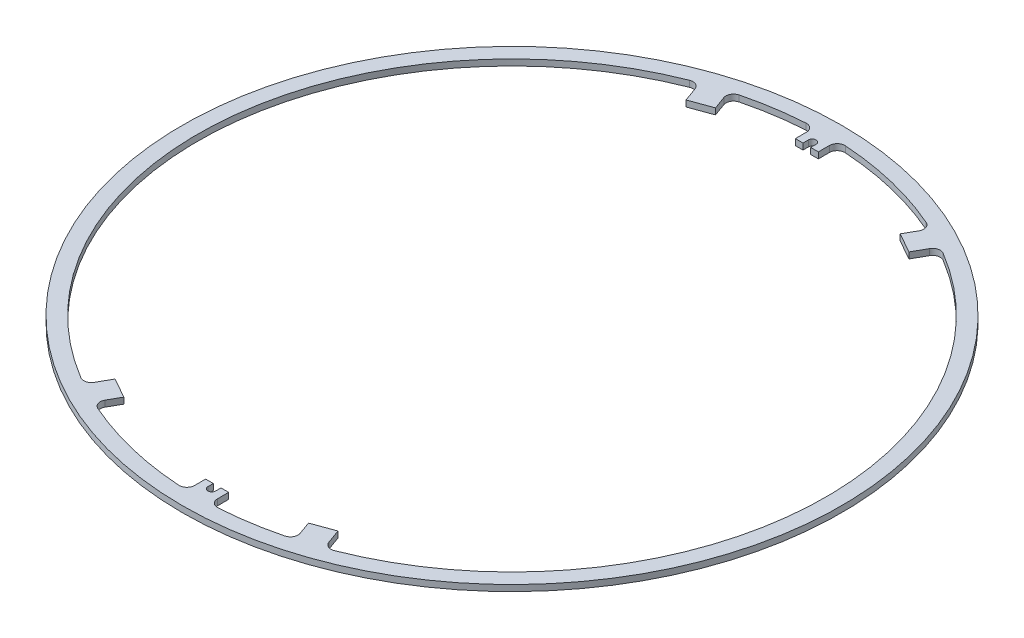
ISO-10303-21;
HEADER;
FILE_DESCRIPTION(('STEP AP214'),'2;1');
FILE_NAME('part.step','',(''),(''),'','','');
FILE_SCHEMA(('AUTOMOTIVE_DESIGN { 1 0 10303 214 1 1 1 1 }'));
ENDSEC;
DATA;
#1=APPLICATION_CONTEXT('core data for automotive mechanical design processes');
#2=APPLICATION_PROTOCOL_DEFINITION('international standard','automotive_design',2000,#1);
#3=PRODUCT_CONTEXT('',#1,'mechanical');
#4=PRODUCT('Part','Part','',(#3));
#5=PRODUCT_RELATED_PRODUCT_CATEGORY('part','',(#4));
#6=PRODUCT_DEFINITION_FORMATION('','',#4);
#7=PRODUCT_DEFINITION_CONTEXT('part definition',#1,'design');
#8=PRODUCT_DEFINITION('design','',#6,#7);
#9=PRODUCT_DEFINITION_SHAPE('','',#8);
#10=(LENGTH_UNIT() NAMED_UNIT(*) SI_UNIT(.MILLI.,.METRE.));
#11=(NAMED_UNIT(*) PLANE_ANGLE_UNIT() SI_UNIT($,.RADIAN.));
#12=(NAMED_UNIT(*) SI_UNIT($,.STERADIAN.) SOLID_ANGLE_UNIT());
#13=UNCERTAINTY_MEASURE_WITH_UNIT(LENGTH_MEASURE(1.E-05),#10,'distance_accuracy_value','');
#14=(GEOMETRIC_REPRESENTATION_CONTEXT(3) GLOBAL_UNCERTAINTY_ASSIGNED_CONTEXT((#13)) GLOBAL_UNIT_ASSIGNED_CONTEXT((#10,
#11,#12)) REPRESENTATION_CONTEXT('',''));
#15=CARTESIAN_POINT('',(0.,0.,0.));
#16=DIRECTION('',(0.,0.,1.));
#17=DIRECTION('',(1.,0.,0.));
#18=AXIS2_PLACEMENT_3D('',#15,#16,#17);
#19=CARTESIAN_POINT('',(0.,0.8,0.));
#20=DIRECTION('',(0.,-1.,0.));
#21=DIRECTION('',(0.,0.,-1.));
#22=AXIS2_PLACEMENT_3D('',#19,#20,#21);
#23=CYLINDRICAL_SURFACE('',#22,41.);
#24=CARTESIAN_POINT('',(0.,0.8,0.));
#25=DIRECTION('',(0.,1.,0.));
#26=DIRECTION('',(0.,0.,1.));
#27=AXIS2_PLACEMENT_3D('',#24,#25,#26);
#28=CIRCLE('',#27,41.);
#29=CARTESIAN_POINT('',(-2.5625,0.8,-40.9198435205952));
#30=VERTEX_POINT('',#29);
#31=CARTESIAN_POINT('',(-10.0997958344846,0.8,-39.7365590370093));
#32=VERTEX_POINT('',#31);
#33=EDGE_CURVE('E503',#30,#32,#28,.T.);
#34=ORIENTED_EDGE('',*,*,#33,.T.);
#35=DIRECTION('',(0.,-1.,0.));
#36=VECTOR('',#35,1.);
#37=CARTESIAN_POINT('',(-10.0997958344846,0.8,-39.7365590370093));
#38=LINE('',#37,#36);
#39=CARTESIAN_POINT('',(-10.0997958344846,0.,-39.7365590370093));
#40=VERTEX_POINT('',#39);
#41=EDGE_CURVE('E605',#32,#40,#38,.T.);
#42=ORIENTED_EDGE('',*,*,#41,.T.);
#43=CARTESIAN_POINT('',(0.,0.,0.));
#44=DIRECTION('',(0.,1.,0.));
#45=DIRECTION('',(0.,0.,1.));
#46=AXIS2_PLACEMENT_3D('',#43,#44,#45);
#47=CIRCLE('',#46,41.);
#48=CARTESIAN_POINT('',(-2.5625,0.,-40.9198435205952));
#49=VERTEX_POINT('',#48);
#50=EDGE_CURVE('E509',#49,#40,#47,.T.);
#51=ORIENTED_EDGE('',*,*,#50,.F.);
#52=DIRECTION('',(0.,-1.,0.));
#53=VECTOR('',#52,1.);
#54=CARTESIAN_POINT('',(-2.5625,0.8,-40.9198435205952));
#55=LINE('',#54,#53);
#56=EDGE_CURVE('E521',#49,#30,#55,.F.);
#57=ORIENTED_EDGE('',*,*,#56,.T.);
#58=EDGE_LOOP('',(#34,#42,#51,#57));
#59=FACE_BOUND('',#58,.T.);
#60=ADVANCED_FACE('F37',(#59),#23,.F.);
#61=CARTESIAN_POINT('',(2.5625,0.8,40.9198435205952));
#62=VERTEX_POINT('',#61);
#63=CARTESIAN_POINT('',(10.0997958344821,0.8,39.73655903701));
#64=VERTEX_POINT('',#63);
#65=EDGE_CURVE('E498',#62,#64,#28,.T.);
#66=ORIENTED_EDGE('',*,*,#65,.T.);
#67=DIRECTION('',(0.,-1.,0.));
#68=VECTOR('',#67,1.);
#69=CARTESIAN_POINT('',(10.0997958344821,0.8,39.73655903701));
#70=LINE('',#69,#68);
#71=CARTESIAN_POINT('',(10.0997958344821,0.,39.73655903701));
#72=VERTEX_POINT('',#71);
#73=EDGE_CURVE('E614',#64,#72,#70,.T.);
#74=ORIENTED_EDGE('',*,*,#73,.T.);
#75=CARTESIAN_POINT('',(2.5625,0.,40.9198435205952));
#76=VERTEX_POINT('',#75);
#77=EDGE_CURVE('E504',#76,#72,#47,.T.);
#78=ORIENTED_EDGE('',*,*,#77,.F.);
#79=DIRECTION('',(0.,-1.,0.));
#80=VECTOR('',#79,1.);
#81=CARTESIAN_POINT('',(2.5625,0.8,40.9198435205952));
#82=LINE('',#81,#80);
#83=EDGE_CURVE('E535',#76,#62,#82,.F.);
#84=ORIENTED_EDGE('',*,*,#83,.T.);
#85=EDGE_LOOP('',(#66,#74,#78,#84));
#86=FACE_BOUND('',#85,.T.);
#87=ADVANCED_FACE('F642',(#86),#23,.F.);
#88=CARTESIAN_POINT('',(14.9816279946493,0.,38.1647851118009));
#89=VERTEX_POINT('',#88);
#90=CARTESIAN_POINT('',(21.0751703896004,0.,-35.1686962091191));
#91=VERTEX_POINT('',#90);
#92=EDGE_CURVE('E508',#89,#91,#47,.T.);
#93=ORIENTED_EDGE('',*,*,#92,.F.);
#94=DIRECTION('',(0.,-1.,0.));
#95=VECTOR('',#94,1.);
#96=CARTESIAN_POINT('',(14.9816279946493,0.8,38.1647851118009));
#97=LINE('',#96,#95);
#98=CARTESIAN_POINT('',(14.9816279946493,0.8,38.1647851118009));
#99=VERTEX_POINT('',#98);
#100=EDGE_CURVE('E58',#89,#99,#97,.F.);
#101=ORIENTED_EDGE('',*,*,#100,.T.);
#102=CARTESIAN_POINT('',(21.0751703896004,0.8,-35.1686962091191));
#103=VERTEX_POINT('',#102);
#104=EDGE_CURVE('E502',#99,#103,#28,.T.);
#105=ORIENTED_EDGE('',*,*,#104,.T.);
#106=DIRECTION('',(0.,-1.,0.));
#107=VECTOR('',#106,1.);
#108=CARTESIAN_POINT('',(21.0751703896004,0.8,-35.1686962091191));
#109=LINE('',#108,#107);
#110=EDGE_CURVE('E568',#103,#91,#109,.T.);
#111=ORIENTED_EDGE('',*,*,#110,.T.);
#112=EDGE_LOOP('',(#93,#101,#105,#111));
#113=FACE_BOUND('',#112,.T.);
#114=ADVANCED_FACE('F727',(#113),#23,.F.);
#115=CARTESIAN_POINT('',(-14.9816279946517,0.,-38.1647851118));
#116=VERTEX_POINT('',#115);
#117=CARTESIAN_POINT('',(-21.0751703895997,0.,35.1686962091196));
#118=VERTEX_POINT('',#117);
#119=EDGE_CURVE('E752',#116,#118,#47,.T.);
#120=ORIENTED_EDGE('',*,*,#119,.F.);
#121=DIRECTION('',(0.,-1.,0.));
#122=VECTOR('',#121,1.);
#123=CARTESIAN_POINT('',(-14.9816279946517,0.8,-38.1647851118));
#124=LINE('',#123,#122);
#125=CARTESIAN_POINT('',(-14.9816279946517,0.8,-38.1647851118));
#126=VERTEX_POINT('',#125);
#127=EDGE_CURVE('E612',#116,#126,#124,.F.);
#128=ORIENTED_EDGE('',*,*,#127,.T.);
#129=CARTESIAN_POINT('',(-21.0751703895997,0.8,35.1686962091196));
#130=VERTEX_POINT('',#129);
#131=EDGE_CURVE('E664',#126,#130,#28,.T.);
#132=ORIENTED_EDGE('',*,*,#131,.T.);
#133=DIRECTION('',(0.,-1.,0.));
#134=VECTOR('',#133,1.);
#135=CARTESIAN_POINT('',(-21.0751703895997,0.8,35.1686962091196));
#136=LINE('',#135,#134);
#137=EDGE_CURVE('E584',#130,#118,#136,.T.);
#138=ORIENTED_EDGE('',*,*,#137,.T.);
#139=EDGE_LOOP('',(#120,#128,#132,#138));
#140=FACE_BOUND('',#139,.T.);
#141=ADVANCED_FACE('F738',(#140),#23,.F.);
#142=CARTESIAN_POINT('',(0.,-3.92275342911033,38.4725517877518));
#143=DIRECTION('',(0.,0.,1.));
#144=DIRECTION('',(1.,0.,0.));
#145=AXIS2_PLACEMENT_3D('',#142,#143,#144);
#146=PLANE('',#145);
#147=DIRECTION('',(-1.,0.,0.));
#148=VECTOR('',#147,1.);
#149=CARTESIAN_POINT('',(0.,0.,38.4725517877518));
#150=LINE('',#149,#148);
#151=CARTESIAN_POINT('',(1.5,0.,38.4725517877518));
#152=VERTEX_POINT('',#151);
#153=CARTESIAN_POINT('',(0.5,0.,38.4725517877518));
#154=VERTEX_POINT('',#153);
#155=EDGE_CURVE('E478',#152,#154,#150,.T.);
#156=ORIENTED_EDGE('',*,*,#155,.T.);
#157=DIRECTION('',(0.,1.,0.));
#158=VECTOR('',#157,1.);
#159=CARTESIAN_POINT('',(0.5,-3.92275342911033,38.4725517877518));
#160=LINE('',#159,#158);
#161=CARTESIAN_POINT('',(0.5,0.8,38.4725517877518));
#162=VERTEX_POINT('',#161);
#163=EDGE_CURVE('E562',#154,#162,#160,.T.);
#164=ORIENTED_EDGE('',*,*,#163,.T.);
#165=DIRECTION('',(1.,0.,0.));
#166=VECTOR('',#165,1.);
#167=CARTESIAN_POINT('',(0.,0.8,38.4725517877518));
#168=LINE('',#167,#166);
#169=CARTESIAN_POINT('',(1.5,0.8,38.4725517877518));
#170=VERTEX_POINT('',#169);
#171=EDGE_CURVE('E459',#162,#170,#168,.T.);
#172=ORIENTED_EDGE('',*,*,#171,.T.);
#173=DIRECTION('',(0.,1.,0.));
#174=VECTOR('',#173,1.);
#175=CARTESIAN_POINT('',(1.5,-3.92275342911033,38.4725517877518));
#176=LINE('',#175,#174);
#177=EDGE_CURVE('E491',#152,#170,#176,.T.);
#178=ORIENTED_EDGE('',*,*,#177,.F.);
#179=EDGE_LOOP('',(#156,#164,#172,#178));
#180=FACE_BOUND('',#179,.T.);
#181=ADVANCED_FACE('F699',(#180),#146,.F.);
#182=CARTESIAN_POINT('',(0.,-3.92275342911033,-38.4725517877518));
#183=DIRECTION('',(0.,0.,1.));
#184=DIRECTION('',(1.,0.,0.));
#185=AXIS2_PLACEMENT_3D('',#182,#183,#184);
#186=PLANE('',#185);
#187=DIRECTION('',(0.,-1.,0.));
#188=VECTOR('',#187,1.);
#189=CARTESIAN_POINT('',(-0.5,-3.92275342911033,-38.4725517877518));
#190=LINE('',#189,#188);
#191=CARTESIAN_POINT('',(-0.5,0.8,-38.4725517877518));
#192=VERTEX_POINT('',#191);
#193=CARTESIAN_POINT('',(-0.5,0.,-38.4725517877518));
#194=VERTEX_POINT('',#193);
#195=EDGE_CURVE('E557',#192,#194,#190,.T.);
#196=ORIENTED_EDGE('',*,*,#195,.F.);
#197=DIRECTION('',(1.,0.,0.));
#198=VECTOR('',#197,1.);
#199=CARTESIAN_POINT('',(0.,0.8,-38.4725517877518));
#200=LINE('',#199,#198);
#201=CARTESIAN_POINT('',(-1.5,0.8,-38.4725517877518));
#202=VERTEX_POINT('',#201);
#203=EDGE_CURVE('E465',#202,#192,#200,.T.);
#204=ORIENTED_EDGE('',*,*,#203,.F.);
#205=DIRECTION('',(0.,1.,0.));
#206=VECTOR('',#205,1.);
#207=CARTESIAN_POINT('',(-1.5,-3.92275342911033,-38.4725517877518));
#208=LINE('',#207,#206);
#209=CARTESIAN_POINT('',(-1.5,0.,-38.4725517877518));
#210=VERTEX_POINT('',#209);
#211=EDGE_CURVE('E468',#210,#202,#208,.T.);
#212=ORIENTED_EDGE('',*,*,#211,.F.);
#213=DIRECTION('',(-1.,0.,0.));
#214=VECTOR('',#213,1.);
#215=CARTESIAN_POINT('',(0.,0.,-38.4725517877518));
#216=LINE('',#215,#214);
#217=EDGE_CURVE('E451',#194,#210,#216,.T.);
#218=ORIENTED_EDGE('',*,*,#217,.F.);
#219=EDGE_LOOP('',(#196,#204,#212,#218));
#220=FACE_BOUND('',#219,.T.);
#221=ADVANCED_FACE('F736',(#220),#186,.T.);
#222=CARTESIAN_POINT('',(16.5197071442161,0.,-37.5246489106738));
#223=VERTEX_POINT('',#222);
#224=CARTESIAN_POINT('',(2.5625,0.,-40.9198435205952));
#225=VERTEX_POINT('',#224);
#226=EDGE_CURVE('E809',#223,#225,#47,.T.);
#227=ORIENTED_EDGE('',*,*,#226,.F.);
#228=DIRECTION('',(0.,-1.,0.));
#229=VECTOR('',#228,1.);
#230=CARTESIAN_POINT('',(16.5197071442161,0.8,-37.5246489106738));
#231=LINE('',#230,#229);
#232=CARTESIAN_POINT('',(16.5197071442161,0.8,-37.5246489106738));
#233=VERTEX_POINT('',#232);
#234=EDGE_CURVE('E571',#223,#233,#231,.F.);
#235=ORIENTED_EDGE('',*,*,#234,.T.);
#236=CARTESIAN_POINT('',(2.5625,0.8,-40.9198435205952));
#237=VERTEX_POINT('',#236);
#238=EDGE_CURVE('E663',#233,#237,#28,.T.);
#239=ORIENTED_EDGE('',*,*,#238,.T.);
#240=DIRECTION('',(0.,-1.,0.));
#241=VECTOR('',#240,1.);
#242=CARTESIAN_POINT('',(2.5625,0.8,-40.9198435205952));
#243=LINE('',#242,#241);
#244=EDGE_CURVE('E518',#237,#225,#243,.T.);
#245=ORIENTED_EDGE('',*,*,#244,.T.);
#246=EDGE_LOOP('',(#227,#235,#239,#245));
#247=FACE_BOUND('',#246,.T.);
#248=ADVANCED_FACE('F731',(#247),#23,.F.);
#249=CARTESIAN_POINT('',(-16.5197071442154,0.,37.5246489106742));
#250=VERTEX_POINT('',#249);
#251=CARTESIAN_POINT('',(-2.5625,0.,40.9198435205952));
#252=VERTEX_POINT('',#251);
#253=EDGE_CURVE('E481',#250,#252,#47,.T.);
#254=ORIENTED_EDGE('',*,*,#253,.F.);
#255=DIRECTION('',(0.,-1.,0.));
#256=VECTOR('',#255,1.);
#257=CARTESIAN_POINT('',(-16.5197071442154,0.8,37.5246489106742));
#258=LINE('',#257,#256);
#259=CARTESIAN_POINT('',(-16.5197071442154,0.8,37.5246489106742));
#260=VERTEX_POINT('',#259);
#261=EDGE_CURVE('E576',#250,#260,#258,.F.);
#262=ORIENTED_EDGE('',*,*,#261,.T.);
#263=CARTESIAN_POINT('',(-2.5625,0.8,40.9198435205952));
#264=VERTEX_POINT('',#263);
#265=EDGE_CURVE('E507',#260,#264,#28,.T.);
#266=ORIENTED_EDGE('',*,*,#265,.T.);
#267=DIRECTION('',(0.,-1.,0.));
#268=VECTOR('',#267,1.);
#269=CARTESIAN_POINT('',(-2.5625,0.8,40.9198435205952));
#270=LINE('',#269,#268);
#271=EDGE_CURVE('E543',#264,#252,#270,.T.);
#272=ORIENTED_EDGE('',*,*,#271,.T.);
#273=EDGE_LOOP('',(#254,#262,#266,#272));
#274=FACE_BOUND('',#273,.T.);
#275=ADVANCED_FACE('F671',(#274),#23,.F.);
#276=CARTESIAN_POINT('',(0.,0.8,0.));
#277=DIRECTION('',(0.,1.,0.));
#278=DIRECTION('',(0.,0.,1.));
#279=AXIS2_PLACEMENT_3D('',#276,#277,#278);
#280=PLANE('',#279);
#281=DIRECTION('',(0.,0.,1.));
#282=VECTOR('',#281,1.);
#283=CARTESIAN_POINT('',(0.5,0.8,36.1725517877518));
#284=LINE('',#283,#282);
#285=CARTESIAN_POINT('',(0.5,0.8,39.1725517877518));
#286=VERTEX_POINT('',#285);
#287=EDGE_CURVE('E414',#162,#286,#284,.T.);
#288=ORIENTED_EDGE('',*,*,#287,.T.);
#289=CARTESIAN_POINT('',(0.,0.8,39.1725517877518));
#290=DIRECTION('',(0.,-1.,0.));
#291=DIRECTION('',(0.,0.,-1.));
#292=AXIS2_PLACEMENT_3D('',#289,#290,#291);
#293=CIRCLE('',#292,0.5);
#294=CARTESIAN_POINT('',(-0.5,0.8,39.1725517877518));
#295=VERTEX_POINT('',#294);
#296=EDGE_CURVE('E407',#286,#295,#293,.T.);
#297=ORIENTED_EDGE('',*,*,#296,.T.);
#298=DIRECTION('',(0.,0.,-1.));
#299=VECTOR('',#298,1.);
#300=CARTESIAN_POINT('',(-0.5,0.8,39.1725517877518));
#301=LINE('',#300,#299);
#302=CARTESIAN_POINT('',(-0.5,0.8,38.4725517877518));
#303=VERTEX_POINT('',#302);
#304=EDGE_CURVE('E410',#295,#303,#301,.T.);
#305=ORIENTED_EDGE('',*,*,#304,.T.);
#306=CARTESIAN_POINT('',(-1.5,0.8,38.4725517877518));
#307=VERTEX_POINT('',#306);
#308=EDGE_CURVE('E482',#307,#303,#168,.T.);
#309=ORIENTED_EDGE('',*,*,#308,.F.);
#310=DIRECTION('',(0.,0.,-1.));
#311=VECTOR('',#310,1.);
#312=CARTESIAN_POINT('',(-1.5,0.8,0.));
#313=LINE('',#312,#311);
#314=CARTESIAN_POINT('',(-1.5,0.8,39.9217985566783));
#315=VERTEX_POINT('',#314);
#316=EDGE_CURVE('E485',#315,#307,#313,.T.);
#317=ORIENTED_EDGE('',*,*,#316,.F.);
#318=CARTESIAN_POINT('',(-2.5,0.8,39.9217985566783));
#319=DIRECTION('',(0.,1.,0.));
#320=DIRECTION('',(0.,0.,1.));
#321=AXIS2_PLACEMENT_3D('',#318,#319,#320);
#322=CIRCLE('',#321,1.);
#323=EDGE_CURVE('E550',#315,#264,#322,.F.);
#324=ORIENTED_EDGE('',*,*,#323,.T.);
#325=ORIENTED_EDGE('',*,*,#265,.F.);
#326=CARTESIAN_POINT('',(-16.1167874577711,0.8,36.6094135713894));
#327=DIRECTION('',(0.,1.,0.));
#328=DIRECTION('',(0.,0.,1.));
#329=AXIS2_PLACEMENT_3D('',#326,#327,#328);
#330=CIRCLE('',#329,1.);
#331=CARTESIAN_POINT('',(-16.987143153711,0.8,36.1169900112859));
#332=VERTEX_POINT('',#331);
#333=EDGE_CURVE('E596',#260,#332,#330,.F.);
#334=ORIENTED_EDGE('',*,*,#333,.T.);
#335=DIRECTION('',(0.492423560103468,0.,-0.870355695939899));
#336=VECTOR('',#335,1.);
#337=CARTESIAN_POINT('',(-16.1010281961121,0.8,34.5507871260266));
#338=LINE('',#337,#336);
#339=CARTESIAN_POINT('',(-16.1010281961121,0.8,34.5507871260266));
#340=VERTEX_POINT('',#339);
#341=EDGE_CURVE('E386',#332,#340,#338,.T.);
#342=ORIENTED_EDGE('',*,*,#341,.T.);
#343=DIRECTION('',(-0.870355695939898,0.,-0.49242356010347));
#344=VECTOR('',#343,1.);
#345=CARTESIAN_POINT('',(-18.7120952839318,0.8,33.0735164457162));
#346=LINE('',#345,#344);
#347=CARTESIAN_POINT('',(-18.7120952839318,0.8,33.0735164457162));
#348=VERTEX_POINT('',#347);
#349=EDGE_CURVE('E394',#340,#348,#346,.T.);
#350=ORIENTED_EDGE('',*,*,#349,.T.);
#351=DIRECTION('',(-0.492423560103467,0.,0.8703556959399));
#352=VECTOR('',#351,1.);
#353=CARTESIAN_POINT('',(-20.1893659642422,0.8,35.6845835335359));
#354=LINE('',#353,#352);
#355=CARTESIAN_POINT('',(-19.690786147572,0.8,34.8033466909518));
#356=VERTEX_POINT('',#355);
#357=EDGE_CURVE('E397',#348,#356,#354,.T.);
#358=ORIENTED_EDGE('',*,*,#357,.T.);
#359=CARTESIAN_POINT('',(-20.5611418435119,0.8,34.3109231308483));
#360=DIRECTION('',(0.,1.,0.));
#361=DIRECTION('',(0.,0.,1.));
#362=AXIS2_PLACEMENT_3D('',#359,#360,#361);
#363=CIRCLE('',#362,1.);
#364=EDGE_CURVE('E600',#356,#130,#363,.F.);
#365=ORIENTED_EDGE('',*,*,#364,.T.);
#366=ORIENTED_EDGE('',*,*,#131,.F.);
#367=CARTESIAN_POINT('',(-14.6162224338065,0.8,-37.233936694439));
#368=DIRECTION('',(0.,1.,0.));
#369=DIRECTION('',(0.,0.,1.));
#370=AXIS2_PLACEMENT_3D('',#367,#368,#369);
#371=CIRCLE('',#370,1.);
#372=CARTESIAN_POINT('',(-13.6765298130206,0.8,-37.5759568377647));
#373=VERTEX_POINT('',#372);
#374=EDGE_CURVE('E629',#126,#373,#371,.F.);
#375=ORIENTED_EDGE('',*,*,#374,.T.);
#376=DIRECTION('',(-0.342020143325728,0.,-0.939692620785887));
#377=VECTOR('',#376,1.);
#378=CARTESIAN_POINT('',(-14.0228258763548,0.8,-38.5273974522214));
#379=LINE('',#378,#377);
#380=CARTESIAN_POINT('',(-12.9967654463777,0.8,-35.7083195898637));
#381=VERTEX_POINT('',#380);
#382=EDGE_CURVE('E335',#381,#373,#379,.T.);
#383=ORIENTED_EDGE('',*,*,#382,.F.);
#384=DIRECTION('',(-0.939692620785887,0.,0.342020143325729));
#385=VECTOR('',#384,1.);
#386=CARTESIAN_POINT('',(-12.9967654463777,0.8,-35.7083195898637));
#387=LINE('',#386,#385);
#388=CARTESIAN_POINT('',(-10.17768758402,0.8,-36.7343800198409));
#389=VERTEX_POINT('',#388);
#390=EDGE_CURVE('E330',#389,#381,#387,.T.);
#391=ORIENTED_EDGE('',*,*,#390,.F.);
#392=DIRECTION('',(0.342020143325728,0.,0.939692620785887));
#393=VECTOR('',#392,1.);
#394=CARTESIAN_POINT('',(-10.17768758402,0.8,-36.7343800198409));
#395=LINE('',#394,#393);
#396=CARTESIAN_POINT('',(-10.7931519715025,0.8,-38.4253545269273));
#397=VERTEX_POINT('',#396);
#398=EDGE_CURVE('E316',#397,#389,#395,.T.);
#399=ORIENTED_EDGE('',*,*,#398,.F.);
#400=CARTESIAN_POINT('',(-9.85345935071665,0.8,-38.767374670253));
#401=DIRECTION('',(0.,1.,0.));
#402=DIRECTION('',(0.,0.,1.));
#403=AXIS2_PLACEMENT_3D('',#400,#401,#402);
#404=CIRCLE('',#403,1.);
#405=EDGE_CURVE('E625',#397,#32,#404,.F.);
#406=ORIENTED_EDGE('',*,*,#405,.T.);
#407=ORIENTED_EDGE('',*,*,#33,.F.);
#408=CARTESIAN_POINT('',(-2.5,0.8,-39.9217985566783));
#409=DIRECTION('',(0.,1.,0.));
#410=DIRECTION('',(0.,0.,1.));
#411=AXIS2_PLACEMENT_3D('',#408,#409,#410);
#412=CIRCLE('',#411,1.);
#413=CARTESIAN_POINT('',(-1.5,0.8,-39.9217985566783));
#414=VERTEX_POINT('',#413);
#415=EDGE_CURVE('E531',#30,#414,#412,.F.);
#416=ORIENTED_EDGE('',*,*,#415,.T.);
#417=DIRECTION('',(0.,0.,1.));
#418=VECTOR('',#417,1.);
#419=CARTESIAN_POINT('',(-1.5,0.8,0.));
#420=LINE('',#419,#418);
#421=EDGE_CURVE('E462',#414,#202,#420,.T.);
#422=ORIENTED_EDGE('',*,*,#421,.T.);
#423=ORIENTED_EDGE('',*,*,#203,.T.);
#424=DIRECTION('',(0.,0.,-1.));
#425=VECTOR('',#424,1.);
#426=CARTESIAN_POINT('',(-0.5,0.8,-39.1725517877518));
#427=LINE('',#426,#425);
#428=CARTESIAN_POINT('',(-0.5,0.8,-39.1725517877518));
#429=VERTEX_POINT('',#428);
#430=EDGE_CURVE('E436',#192,#429,#427,.T.);
#431=ORIENTED_EDGE('',*,*,#430,.T.);
#432=CARTESIAN_POINT('',(0.,0.8,-39.1725517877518));
#433=DIRECTION('',(0.,-1.,0.));
#434=DIRECTION('',(0.,0.,1.));
#435=AXIS2_PLACEMENT_3D('',#432,#433,#434);
#436=CIRCLE('',#435,0.5);
#437=CARTESIAN_POINT('',(0.5,0.8,-39.1725517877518));
#438=VERTEX_POINT('',#437);
#439=EDGE_CURVE('E429',#429,#438,#436,.T.);
#440=ORIENTED_EDGE('',*,*,#439,.T.);
#441=DIRECTION('',(0.,0.,1.));
#442=VECTOR('',#441,1.);
#443=CARTESIAN_POINT('',(0.5,0.8,-36.1725517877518));
#444=LINE('',#443,#442);
#445=CARTESIAN_POINT('',(0.5,0.8,-38.4725517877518));
#446=VERTEX_POINT('',#445);
#447=EDGE_CURVE('E432',#438,#446,#444,.T.);
#448=ORIENTED_EDGE('',*,*,#447,.T.);
#449=CARTESIAN_POINT('',(1.5,0.8,-38.4725517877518));
#450=VERTEX_POINT('',#449);
#451=EDGE_CURVE('E464',#446,#450,#200,.T.);
#452=ORIENTED_EDGE('',*,*,#451,.T.);
#453=DIRECTION('',(0.,0.,1.));
#454=VECTOR('',#453,1.);
#455=CARTESIAN_POINT('',(1.5,0.8,0.));
#456=LINE('',#455,#454);
#457=CARTESIAN_POINT('',(1.5,0.8,-39.9217985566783));
#458=VERTEX_POINT('',#457);
#459=EDGE_CURVE('E427',#458,#450,#456,.T.);
#460=ORIENTED_EDGE('',*,*,#459,.F.);
#461=CARTESIAN_POINT('',(2.5,0.8,-39.9217985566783));
#462=DIRECTION('',(0.,1.,0.));
#463=DIRECTION('',(0.,0.,1.));
#464=AXIS2_PLACEMENT_3D('',#461,#462,#463);
#465=CIRCLE('',#464,1.);
#466=EDGE_CURVE('E526',#458,#237,#465,.F.);
#467=ORIENTED_EDGE('',*,*,#466,.T.);
#468=ORIENTED_EDGE('',*,*,#238,.F.);
#469=CARTESIAN_POINT('',(16.1167874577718,0.8,-36.6094135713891));
#470=DIRECTION('',(0.,1.,0.));
#471=DIRECTION('',(0.,0.,1.));
#472=AXIS2_PLACEMENT_3D('',#469,#470,#471);
#473=CIRCLE('',#472,1.);
#474=CARTESIAN_POINT('',(16.9871431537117,0.8,-36.1169900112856));
#475=VERTEX_POINT('',#474);
#476=EDGE_CURVE('E592',#233,#475,#473,.F.);
#477=ORIENTED_EDGE('',*,*,#476,.T.);
#478=DIRECTION('',(-0.492423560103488,0.,0.870355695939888));
#479=VECTOR('',#478,1.);
#480=CARTESIAN_POINT('',(16.1010281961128,0.8,-34.5507871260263));
#481=LINE('',#480,#479);
#482=CARTESIAN_POINT('',(16.1010281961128,0.8,-34.5507871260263));
#483=VERTEX_POINT('',#482);
#484=EDGE_CURVE('E359',#475,#483,#481,.T.);
#485=ORIENTED_EDGE('',*,*,#484,.T.);
#486=DIRECTION('',(0.870355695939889,0.,0.492423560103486));
#487=VECTOR('',#486,1.);
#488=CARTESIAN_POINT('',(18.7120952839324,0.8,-33.0735164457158));
#489=LINE('',#488,#487);
#490=CARTESIAN_POINT('',(18.7120952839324,0.8,-33.0735164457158));
#491=VERTEX_POINT('',#490);
#492=EDGE_CURVE('E374',#483,#491,#489,.T.);
#493=ORIENTED_EDGE('',*,*,#492,.T.);
#494=DIRECTION('',(0.492423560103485,0.,-0.870355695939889));
#495=VECTOR('',#494,1.);
#496=CARTESIAN_POINT('',(20.1893659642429,0.8,-35.6845835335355));
#497=LINE('',#496,#495);
#498=CARTESIAN_POINT('',(19.6907861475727,0.8,-34.8033466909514));
#499=VERTEX_POINT('',#498);
#500=EDGE_CURVE('E377',#491,#499,#497,.T.);
#501=ORIENTED_EDGE('',*,*,#500,.T.);
#502=CARTESIAN_POINT('',(20.5611418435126,0.8,-34.3109231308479));
#503=DIRECTION('',(0.,1.,0.));
#504=DIRECTION('',(0.,0.,1.));
#505=AXIS2_PLACEMENT_3D('',#502,#503,#504);
#506=CIRCLE('',#505,1.);
#507=EDGE_CURVE('E587',#499,#103,#506,.F.);
#508=ORIENTED_EDGE('',*,*,#507,.T.);
#509=ORIENTED_EDGE('',*,*,#104,.F.);
#510=CARTESIAN_POINT('',(14.6162224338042,0.8,37.2339366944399));
#511=DIRECTION('',(0.,1.,0.));
#512=DIRECTION('',(0.,0.,1.));
#513=AXIS2_PLACEMENT_3D('',#510,#511,#512);
#514=CIRCLE('',#513,1.);
#515=CARTESIAN_POINT('',(13.6765298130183,0.8,37.5759568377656));
#516=VERTEX_POINT('',#515);
#517=EDGE_CURVE('E11',#99,#516,#514,.F.);
#518=ORIENTED_EDGE('',*,*,#517,.T.);
#519=DIRECTION('',(0.342020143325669,0.,0.939692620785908));
#520=VECTOR('',#519,1.);
#521=CARTESIAN_POINT('',(14.0228258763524,0.8,38.5273974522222));
#522=LINE('',#521,#520);
#523=CARTESIAN_POINT('',(12.9967654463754,0.8,35.7083195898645));
#524=VERTEX_POINT('',#523);
#525=EDGE_CURVE('E356',#524,#516,#522,.T.);
#526=ORIENTED_EDGE('',*,*,#525,.F.);
#527=DIRECTION('',(0.939692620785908,0.,-0.342020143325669));
#528=VECTOR('',#527,1.);
#529=CARTESIAN_POINT('',(12.9967654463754,0.8,35.7083195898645));
#530=LINE('',#529,#528);
#531=CARTESIAN_POINT('',(10.1776875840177,0.8,36.7343800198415));
#532=VERTEX_POINT('',#531);
#533=EDGE_CURVE('E361',#532,#524,#530,.T.);
#534=ORIENTED_EDGE('',*,*,#533,.F.);
#535=DIRECTION('',(-0.34202014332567,0.,-0.939692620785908));
#536=VECTOR('',#535,1.);
#537=CARTESIAN_POINT('',(10.1776875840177,0.8,36.7343800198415));
#538=LINE('',#537,#536);
#539=CARTESIAN_POINT('',(10.7931519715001,0.8,38.4253545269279));
#540=VERTEX_POINT('',#539);
#541=EDGE_CURVE('E348',#540,#532,#538,.T.);
#542=ORIENTED_EDGE('',*,*,#541,.F.);
#543=CARTESIAN_POINT('',(9.85345935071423,0.8,38.7673746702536));
#544=DIRECTION('',(0.,1.,0.));
#545=DIRECTION('',(0.,0.,1.));
#546=AXIS2_PLACEMENT_3D('',#543,#544,#545);
#547=CIRCLE('',#546,1.);
#548=EDGE_CURVE('E633',#540,#64,#547,.F.);
#549=ORIENTED_EDGE('',*,*,#548,.T.);
#550=ORIENTED_EDGE('',*,*,#65,.F.);
#551=CARTESIAN_POINT('',(2.5,0.8,39.9217985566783));
#552=DIRECTION('',(0.,1.,0.));
#553=DIRECTION('',(0.,0.,1.));
#554=AXIS2_PLACEMENT_3D('',#551,#552,#553);
#555=CIRCLE('',#554,1.);
#556=CARTESIAN_POINT('',(1.5,0.8,39.9217985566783));
#557=VERTEX_POINT('',#556);
#558=EDGE_CURVE('E546',#62,#557,#555,.F.);
#559=ORIENTED_EDGE('',*,*,#558,.T.);
#560=DIRECTION('',(0.,0.,-1.));
#561=VECTOR('',#560,1.);
#562=CARTESIAN_POINT('',(1.5,0.8,0.));
#563=LINE('',#562,#561);
#564=EDGE_CURVE('E487',#557,#170,#563,.T.);
#565=ORIENTED_EDGE('',*,*,#564,.T.);
#566=ORIENTED_EDGE('',*,*,#171,.F.);
#567=EDGE_LOOP('',(#288,#297,#305,#309,#317,#324,#325,#334,#342,#350,#358,#365,#366,#375,#383,
#391,#399,#406,#407,#416,#422,#423,#431,#440,#448,#452,#460,#467,#468,#477,#485,#493,#501,#508,
#509,#518,#526,#534,#542,#549,#550,#559,#565,#566));
#568=FACE_BOUND('',#567,.T.);
#569=CARTESIAN_POINT('',(0.,0.8,0.));
#570=DIRECTION('',(0.,1.,0.));
#571=DIRECTION('',(0.,0.,1.));
#572=AXIS2_PLACEMENT_3D('',#569,#570,#571);
#573=CIRCLE('',#572,43.);
#574=CARTESIAN_POINT('',(0.,0.8,43.));
#575=VERTEX_POINT('',#574);
#576=EDGE_CURVE('E510',#575,#575,#573,.T.);
#577=ORIENTED_EDGE('',*,*,#576,.T.);
#578=EDGE_LOOP('',(#577));
#579=FACE_BOUND('',#578,.T.);
#580=ADVANCED_FACE('F332',(#568,#579),#280,.T.);
#581=CARTESIAN_POINT('',(0.,0.,0.));
#582=DIRECTION('',(0.,1.,0.));
#583=DIRECTION('',(0.,0.,1.));
#584=AXIS2_PLACEMENT_3D('',#581,#582,#583);
#585=PLANE('',#584);
#586=CARTESIAN_POINT('',(0.,0.,0.));
#587=DIRECTION('',(0.,1.,0.));
#588=DIRECTION('',(0.,0.,1.));
#589=AXIS2_PLACEMENT_3D('',#586,#587,#588);
#590=CIRCLE('',#589,43.);
#591=CARTESIAN_POINT('',(0.,0.,43.));
#592=VERTEX_POINT('',#591);
#593=EDGE_CURVE('E501',#592,#592,#590,.T.);
#594=ORIENTED_EDGE('',*,*,#593,.F.);
#595=EDGE_LOOP('',(#594));
#596=FACE_BOUND('',#595,.T.);
#597=CARTESIAN_POINT('',(0.,0.,39.1725517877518));
#598=DIRECTION('',(0.,-1.,0.));
#599=DIRECTION('',(0.,0.,-1.));
#600=AXIS2_PLACEMENT_3D('',#597,#598,#599);
#601=CIRCLE('',#600,0.5);
#602=CARTESIAN_POINT('',(0.5,0.,39.1725517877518));
#603=VERTEX_POINT('',#602);
#604=CARTESIAN_POINT('',(-0.5,0.,39.1725517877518));
#605=VERTEX_POINT('',#604);
#606=EDGE_CURVE('E417',#603,#605,#601,.T.);
#607=ORIENTED_EDGE('',*,*,#606,.F.);
#608=DIRECTION('',(0.,0.,1.));
#609=VECTOR('',#608,1.);
#610=CARTESIAN_POINT('',(0.5,0.,36.1725517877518));
#611=LINE('',#610,#609);
#612=EDGE_CURVE('E411',#154,#603,#611,.T.);
#613=ORIENTED_EDGE('',*,*,#612,.F.);
#614=ORIENTED_EDGE('',*,*,#155,.F.);
#615=DIRECTION('',(0.,0.,1.));
#616=VECTOR('',#615,1.);
#617=CARTESIAN_POINT('',(1.5,0.,0.));
#618=LINE('',#617,#616);
#619=CARTESIAN_POINT('',(1.5,0.,39.9217985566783));
#620=VERTEX_POINT('',#619);
#621=EDGE_CURVE('E473',#152,#620,#618,.T.);
#622=ORIENTED_EDGE('',*,*,#621,.T.);
#623=CARTESIAN_POINT('',(2.5,0.,39.9217985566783));
#624=DIRECTION('',(0.,1.,0.));
#625=DIRECTION('',(0.,0.,1.));
#626=AXIS2_PLACEMENT_3D('',#623,#624,#625);
#627=CIRCLE('',#626,1.);
#628=EDGE_CURVE('E548',#620,#76,#627,.T.);
#629=ORIENTED_EDGE('',*,*,#628,.T.);
#630=ORIENTED_EDGE('',*,*,#77,.T.);
#631=CARTESIAN_POINT('',(9.85345935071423,0.,38.7673746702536));
#632=DIRECTION('',(0.,1.,0.));
#633=DIRECTION('',(0.,0.,1.));
#634=AXIS2_PLACEMENT_3D('',#631,#632,#633);
#635=CIRCLE('',#634,1.);
#636=CARTESIAN_POINT('',(10.7931519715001,0.,38.4253545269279));
#637=VERTEX_POINT('',#636);
#638=EDGE_CURVE('E631',#72,#637,#635,.T.);
#639=ORIENTED_EDGE('',*,*,#638,.T.);
#640=DIRECTION('',(-0.34202014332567,0.,-0.939692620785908));
#641=VECTOR('',#640,1.);
#642=CARTESIAN_POINT('',(10.1776875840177,0.,36.7343800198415));
#643=LINE('',#642,#641);
#644=CARTESIAN_POINT('',(10.1776875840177,0.,36.7343800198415));
#645=VERTEX_POINT('',#644);
#646=EDGE_CURVE('E352',#637,#645,#643,.T.);
#647=ORIENTED_EDGE('',*,*,#646,.T.);
#648=DIRECTION('',(0.939692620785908,0.,-0.342020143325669));
#649=VECTOR('',#648,1.);
#650=CARTESIAN_POINT('',(12.9967654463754,0.,35.7083195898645));
#651=LINE('',#650,#649);
#652=CARTESIAN_POINT('',(12.9967654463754,0.,35.7083195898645));
#653=VERTEX_POINT('',#652);
#654=EDGE_CURVE('E349',#645,#653,#651,.T.);
#655=ORIENTED_EDGE('',*,*,#654,.T.);
#656=DIRECTION('',(0.342020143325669,0.,0.939692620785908));
#657=VECTOR('',#656,1.);
#658=CARTESIAN_POINT('',(14.0228258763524,0.,38.5273974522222));
#659=LINE('',#658,#657);
#660=CARTESIAN_POINT('',(13.6765298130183,0.,37.5759568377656));
#661=VERTEX_POINT('',#660);
#662=EDGE_CURVE('E346',#653,#661,#659,.T.);
#663=ORIENTED_EDGE('',*,*,#662,.T.);
#664=CARTESIAN_POINT('',(14.6162224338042,0.,37.2339366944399));
#665=DIRECTION('',(0.,1.,0.));
#666=DIRECTION('',(0.,0.,1.));
#667=AXIS2_PLACEMENT_3D('',#664,#665,#666);
#668=CIRCLE('',#667,1.);
#669=EDGE_CURVE('E45',#661,#89,#668,.T.);
#670=ORIENTED_EDGE('',*,*,#669,.T.);
#671=ORIENTED_EDGE('',*,*,#92,.T.);
#672=CARTESIAN_POINT('',(20.5611418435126,0.,-34.3109231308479));
#673=DIRECTION('',(0.,1.,0.));
#674=DIRECTION('',(0.,0.,1.));
#675=AXIS2_PLACEMENT_3D('',#672,#673,#674);
#676=CIRCLE('',#675,1.);
#677=CARTESIAN_POINT('',(19.6907861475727,0.,-34.8033466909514));
#678=VERTEX_POINT('',#677);
#679=EDGE_CURVE('E590',#91,#678,#676,.T.);
#680=ORIENTED_EDGE('',*,*,#679,.T.);
#681=DIRECTION('',(-0.492423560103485,0.,0.870355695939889));
#682=VECTOR('',#681,1.);
#683=CARTESIAN_POINT('',(20.1893659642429,0.,-35.6845835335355));
#684=LINE('',#683,#682);
#685=CARTESIAN_POINT('',(18.7120952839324,0.,-33.0735164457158));
#686=VERTEX_POINT('',#685);
#687=EDGE_CURVE('E369',#678,#686,#684,.T.);
#688=ORIENTED_EDGE('',*,*,#687,.T.);
#689=DIRECTION('',(-0.870355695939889,0.,-0.492423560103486));
#690=VECTOR('',#689,1.);
#691=CARTESIAN_POINT('',(18.7120952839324,0.,-33.0735164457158));
#692=LINE('',#691,#690);
#693=CARTESIAN_POINT('',(16.1010281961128,0.,-34.5507871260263));
#694=VERTEX_POINT('',#693);
#695=EDGE_CURVE('E367',#686,#694,#692,.T.);
#696=ORIENTED_EDGE('',*,*,#695,.T.);
#697=DIRECTION('',(0.492423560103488,0.,-0.870355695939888));
#698=VECTOR('',#697,1.);
#699=CARTESIAN_POINT('',(16.1010281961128,0.,-34.5507871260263));
#700=LINE('',#699,#698);
#701=CARTESIAN_POINT('',(16.9871431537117,0.,-36.1169900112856));
#702=VERTEX_POINT('',#701);
#703=EDGE_CURVE('E372',#694,#702,#700,.T.);
#704=ORIENTED_EDGE('',*,*,#703,.T.);
#705=CARTESIAN_POINT('',(16.1167874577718,0.,-36.6094135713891));
#706=DIRECTION('',(0.,1.,0.));
#707=DIRECTION('',(0.,0.,1.));
#708=AXIS2_PLACEMENT_3D('',#705,#706,#707);
#709=CIRCLE('',#708,1.);
#710=EDGE_CURVE('E594',#702,#223,#709,.T.);
#711=ORIENTED_EDGE('',*,*,#710,.T.);
#712=ORIENTED_EDGE('',*,*,#226,.T.);
#713=CARTESIAN_POINT('',(2.5,0.,-39.9217985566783));
#714=DIRECTION('',(0.,1.,0.));
#715=DIRECTION('',(0.,0.,1.));
#716=AXIS2_PLACEMENT_3D('',#713,#714,#715);
#717=CIRCLE('',#716,1.);
#718=CARTESIAN_POINT('',(1.5,0.,-39.9217985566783));
#719=VERTEX_POINT('',#718);
#720=EDGE_CURVE('E529',#225,#719,#717,.T.);
#721=ORIENTED_EDGE('',*,*,#720,.T.);
#722=DIRECTION('',(0.,0.,-1.));
#723=VECTOR('',#722,1.);
#724=CARTESIAN_POINT('',(1.5,0.,0.));
#725=LINE('',#724,#723);
#726=CARTESIAN_POINT('',(1.5,0.,-38.4725517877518));
#727=VERTEX_POINT('',#726);
#728=EDGE_CURVE('E456',#727,#719,#725,.T.);
#729=ORIENTED_EDGE('',*,*,#728,.F.);
#730=CARTESIAN_POINT('',(0.5,0.,-38.4725517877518));
#731=VERTEX_POINT('',#730);
#732=EDGE_CURVE('E453',#727,#731,#216,.T.);
#733=ORIENTED_EDGE('',*,*,#732,.T.);
#734=DIRECTION('',(0.,0.,1.));
#735=VECTOR('',#734,1.);
#736=CARTESIAN_POINT('',(0.5,0.,-36.1725517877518));
#737=LINE('',#736,#735);
#738=CARTESIAN_POINT('',(0.5,0.,-39.1725517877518));
#739=VERTEX_POINT('',#738);
#740=EDGE_CURVE('E442',#739,#731,#737,.T.);
#741=ORIENTED_EDGE('',*,*,#740,.F.);
#742=CARTESIAN_POINT('',(0.,0.,-39.1725517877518));
#743=DIRECTION('',(0.,-1.,0.));
#744=DIRECTION('',(0.,0.,1.));
#745=AXIS2_PLACEMENT_3D('',#742,#743,#744);
#746=CIRCLE('',#745,0.5);
#747=CARTESIAN_POINT('',(-0.5,0.,-39.1725517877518));
#748=VERTEX_POINT('',#747);
#749=EDGE_CURVE('E406',#748,#739,#746,.T.);
#750=ORIENTED_EDGE('',*,*,#749,.F.);
#751=DIRECTION('',(0.,0.,-1.));
#752=VECTOR('',#751,1.);
#753=CARTESIAN_POINT('',(-0.5,0.,-39.1725517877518));
#754=LINE('',#753,#752);
#755=EDGE_CURVE('E433',#194,#748,#754,.T.);
#756=ORIENTED_EDGE('',*,*,#755,.F.);
#757=ORIENTED_EDGE('',*,*,#217,.T.);
#758=DIRECTION('',(0.,0.,-1.));
#759=VECTOR('',#758,1.);
#760=CARTESIAN_POINT('',(-1.5,0.,0.));
#761=LINE('',#760,#759);
#762=CARTESIAN_POINT('',(-1.5,0.,-39.9217985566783));
#763=VERTEX_POINT('',#762);
#764=EDGE_CURVE('E448',#210,#763,#761,.T.);
#765=ORIENTED_EDGE('',*,*,#764,.T.);
#766=CARTESIAN_POINT('',(-2.5,0.,-39.9217985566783));
#767=DIRECTION('',(0.,1.,0.));
#768=DIRECTION('',(0.,0.,1.));
#769=AXIS2_PLACEMENT_3D('',#766,#767,#768);
#770=CIRCLE('',#769,1.);
#771=EDGE_CURVE('E533',#763,#49,#770,.T.);
#772=ORIENTED_EDGE('',*,*,#771,.T.);
#773=ORIENTED_EDGE('',*,*,#50,.T.);
#774=CARTESIAN_POINT('',(-9.85345935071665,0.,-38.767374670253));
#775=DIRECTION('',(0.,1.,0.));
#776=DIRECTION('',(0.,0.,1.));
#777=AXIS2_PLACEMENT_3D('',#774,#775,#776);
#778=CIRCLE('',#777,1.);
#779=CARTESIAN_POINT('',(-10.7931519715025,0.,-38.4253545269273));
#780=VERTEX_POINT('',#779);
#781=EDGE_CURVE('E623',#40,#780,#778,.T.);
#782=ORIENTED_EDGE('',*,*,#781,.T.);
#783=DIRECTION('',(0.342020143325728,0.,0.939692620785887));
#784=VECTOR('',#783,1.);
#785=CARTESIAN_POINT('',(-10.17768758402,0.,-36.7343800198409));
#786=LINE('',#785,#784);
#787=CARTESIAN_POINT('',(-10.17768758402,0.,-36.7343800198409));
#788=VERTEX_POINT('',#787);
#789=EDGE_CURVE('E766',#780,#788,#786,.T.);
#790=ORIENTED_EDGE('',*,*,#789,.T.);
#791=DIRECTION('',(-0.939692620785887,0.,0.342020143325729));
#792=VECTOR('',#791,1.);
#793=CARTESIAN_POINT('',(-12.9967654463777,0.,-35.7083195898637));
#794=LINE('',#793,#792);
#795=CARTESIAN_POINT('',(-12.9967654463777,0.,-35.7083195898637));
#796=VERTEX_POINT('',#795);
#797=EDGE_CURVE('E342',#788,#796,#794,.T.);
#798=ORIENTED_EDGE('',*,*,#797,.T.);
#799=DIRECTION('',(-0.342020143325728,0.,-0.939692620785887));
#800=VECTOR('',#799,1.);
#801=CARTESIAN_POINT('',(-14.0228258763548,0.,-38.5273974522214));
#802=LINE('',#801,#800);
#803=CARTESIAN_POINT('',(-13.6765298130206,0.,-37.5759568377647));
#804=VERTEX_POINT('',#803);
#805=EDGE_CURVE('E327',#796,#804,#802,.T.);
#806=ORIENTED_EDGE('',*,*,#805,.T.);
#807=CARTESIAN_POINT('',(-14.6162224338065,0.,-37.233936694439));
#808=DIRECTION('',(0.,1.,0.));
#809=DIRECTION('',(0.,0.,1.));
#810=AXIS2_PLACEMENT_3D('',#807,#808,#809);
#811=CIRCLE('',#810,1.);
#812=EDGE_CURVE('E627',#804,#116,#811,.T.);
#813=ORIENTED_EDGE('',*,*,#812,.T.);
#814=ORIENTED_EDGE('',*,*,#119,.T.);
#815=CARTESIAN_POINT('',(-20.5611418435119,0.,34.3109231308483));
#816=DIRECTION('',(0.,1.,0.));
#817=DIRECTION('',(0.,0.,1.));
#818=AXIS2_PLACEMENT_3D('',#815,#816,#817);
#819=CIRCLE('',#818,1.);
#820=CARTESIAN_POINT('',(-19.690786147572,0.,34.8033466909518));
#821=VERTEX_POINT('',#820);
#822=EDGE_CURVE('E603',#118,#821,#819,.T.);
#823=ORIENTED_EDGE('',*,*,#822,.T.);
#824=DIRECTION('',(0.492423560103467,0.,-0.8703556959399));
#825=VECTOR('',#824,1.);
#826=CARTESIAN_POINT('',(-20.1893659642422,0.,35.6845835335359));
#827=LINE('',#826,#825);
#828=CARTESIAN_POINT('',(-18.7120952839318,0.,33.0735164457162));
#829=VERTEX_POINT('',#828);
#830=EDGE_CURVE('E389',#821,#829,#827,.T.);
#831=ORIENTED_EDGE('',*,*,#830,.T.);
#832=DIRECTION('',(0.870355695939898,0.,0.492423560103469));
#833=VECTOR('',#832,1.);
#834=CARTESIAN_POINT('',(-18.7120952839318,0.,33.0735164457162));
#835=LINE('',#834,#833);
#836=CARTESIAN_POINT('',(-16.1010281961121,0.,34.5507871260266));
#837=VERTEX_POINT('',#836);
#838=EDGE_CURVE('E387',#829,#837,#835,.T.);
#839=ORIENTED_EDGE('',*,*,#838,.T.);
#840=DIRECTION('',(-0.492423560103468,0.,0.870355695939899));
#841=VECTOR('',#840,1.);
#842=CARTESIAN_POINT('',(-16.1010281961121,0.,34.5507871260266));
#843=LINE('',#842,#841);
#844=CARTESIAN_POINT('',(-16.987143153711,0.,36.1169900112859));
#845=VERTEX_POINT('',#844);
#846=EDGE_CURVE('E392',#837,#845,#843,.T.);
#847=ORIENTED_EDGE('',*,*,#846,.T.);
#848=CARTESIAN_POINT('',(-16.1167874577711,0.,36.6094135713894));
#849=DIRECTION('',(0.,1.,0.));
#850=DIRECTION('',(0.,0.,1.));
#851=AXIS2_PLACEMENT_3D('',#848,#849,#850);
#852=CIRCLE('',#851,1.);
#853=EDGE_CURVE('E598',#845,#250,#852,.T.);
#854=ORIENTED_EDGE('',*,*,#853,.T.);
#855=ORIENTED_EDGE('',*,*,#253,.T.);
#856=CARTESIAN_POINT('',(-2.5,0.,39.9217985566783));
#857=DIRECTION('',(0.,1.,0.));
#858=DIRECTION('',(0.,0.,1.));
#859=AXIS2_PLACEMENT_3D('',#856,#857,#858);
#860=CIRCLE('',#859,1.);
#861=CARTESIAN_POINT('',(-1.5,0.,39.9217985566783));
#862=VERTEX_POINT('',#861);
#863=EDGE_CURVE('E553',#252,#862,#860,.T.);
#864=ORIENTED_EDGE('',*,*,#863,.T.);
#865=DIRECTION('',(0.,0.,1.));
#866=VECTOR('',#865,1.);
#867=CARTESIAN_POINT('',(-1.5,0.,0.));
#868=LINE('',#867,#866);
#869=CARTESIAN_POINT('',(-1.5,0.,38.4725517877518));
#870=VERTEX_POINT('',#869);
#871=EDGE_CURVE('E477',#870,#862,#868,.T.);
#872=ORIENTED_EDGE('',*,*,#871,.F.);
#873=CARTESIAN_POINT('',(-0.500000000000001,0.,38.4725517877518));
#874=VERTEX_POINT('',#873);
#875=EDGE_CURVE('E476',#874,#870,#150,.T.);
#876=ORIENTED_EDGE('',*,*,#875,.F.);
#877=DIRECTION('',(0.,0.,-1.));
#878=VECTOR('',#877,1.);
#879=CARTESIAN_POINT('',(-0.5,0.,39.1725517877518));
#880=LINE('',#879,#878);
#881=EDGE_CURVE('E420',#605,#874,#880,.T.);
#882=ORIENTED_EDGE('',*,*,#881,.F.);
#883=EDGE_LOOP('',(#607,#613,#614,#622,#629,#630,#639,#647,#655,#663,#670,#671,#680,#688,#696,
#704,#711,#712,#721,#729,#733,#741,#750,#756,#757,#765,#772,#773,#782,#790,#798,#806,#813,#814,
#823,#831,#839,#847,#854,#855,#864,#872,#876,#882));
#884=FACE_BOUND('',#883,.T.);
#885=ADVANCED_FACE('F648',(#596,#884),#585,.F.);
#886=CARTESIAN_POINT('',(0.,0.8,0.));
#887=DIRECTION('',(0.,-1.,0.));
#888=DIRECTION('',(0.,0.,-1.));
#889=AXIS2_PLACEMENT_3D('',#886,#887,#888);
#890=CYLINDRICAL_SURFACE('',#889,43.);
#891=ORIENTED_EDGE('',*,*,#576,.F.);
#892=EDGE_LOOP('',(#891));
#893=FACE_BOUND('',#892,.T.);
#894=ORIENTED_EDGE('',*,*,#593,.T.);
#895=EDGE_LOOP('',(#894));
#896=FACE_BOUND('',#895,.T.);
#897=ADVANCED_FACE('F920',(#893,#896),#890,.T.);
#898=CARTESIAN_POINT('',(-1.5,-3.92275342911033,0.));
#899=DIRECTION('',(1.,0.,0.));
#900=DIRECTION('',(0.,0.,-1.));
#901=AXIS2_PLACEMENT_3D('',#898,#899,#900);
#902=PLANE('',#901);
#903=ORIENTED_EDGE('',*,*,#871,.T.);
#904=DIRECTION('',(0.,-1.,0.));
#905=VECTOR('',#904,1.);
#906=CARTESIAN_POINT('',(-1.5,-3.92275342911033,39.9217985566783));
#907=LINE('',#906,#905);
#908=EDGE_CURVE('E540',#862,#315,#907,.F.);
#909=ORIENTED_EDGE('',*,*,#908,.T.);
#910=ORIENTED_EDGE('',*,*,#316,.T.);
#911=DIRECTION('',(0.,1.,0.));
#912=VECTOR('',#911,1.);
#913=CARTESIAN_POINT('',(-1.5,-3.92275342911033,38.4725517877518));
#914=LINE('',#913,#912);
#915=EDGE_CURVE('E490',#870,#307,#914,.T.);
#916=ORIENTED_EDGE('',*,*,#915,.F.);
#917=EDGE_LOOP('',(#903,#909,#910,#916));
#918=FACE_BOUND('',#917,.T.);
#919=ADVANCED_FACE('F684',(#918),#902,.F.);
#920=CARTESIAN_POINT('',(1.5,-3.92275342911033,0.));
#921=DIRECTION('',(1.,0.,0.));
#922=DIRECTION('',(0.,0.,-1.));
#923=AXIS2_PLACEMENT_3D('',#920,#921,#922);
#924=PLANE('',#923);
#925=ORIENTED_EDGE('',*,*,#564,.F.);
#926=DIRECTION('',(0.,1.,0.));
#927=VECTOR('',#926,1.);
#928=CARTESIAN_POINT('',(1.5,0.,39.9217985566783));
#929=LINE('',#928,#927);
#930=EDGE_CURVE('E538',#557,#620,#929,.F.);
#931=ORIENTED_EDGE('',*,*,#930,.T.);
#932=ORIENTED_EDGE('',*,*,#621,.F.);
#933=ORIENTED_EDGE('',*,*,#177,.T.);
#934=EDGE_LOOP('',(#925,#931,#932,#933));
#935=FACE_BOUND('',#934,.T.);
#936=ADVANCED_FACE('F705',(#935),#924,.T.);
#937=ORIENTED_EDGE('',*,*,#308,.T.);
#938=DIRECTION('',(0.,-1.,0.));
#939=VECTOR('',#938,1.);
#940=CARTESIAN_POINT('',(-0.5,-3.92275342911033,38.4725517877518));
#941=LINE('',#940,#939);
#942=EDGE_CURVE('E559',#303,#874,#941,.T.);
#943=ORIENTED_EDGE('',*,*,#942,.T.);
#944=ORIENTED_EDGE('',*,*,#875,.T.);
#945=ORIENTED_EDGE('',*,*,#915,.T.);
#946=EDGE_LOOP('',(#937,#943,#944,#945));
#947=FACE_BOUND('',#946,.T.);
#948=ADVANCED_FACE('F686',(#947),#146,.F.);
#949=CARTESIAN_POINT('',(-1.5,-3.92275342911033,0.));
#950=DIRECTION('',(-1.,0.,0.));
#951=DIRECTION('',(0.,0.,1.));
#952=AXIS2_PLACEMENT_3D('',#949,#950,#951);
#953=PLANE('',#952);
#954=ORIENTED_EDGE('',*,*,#421,.F.);
#955=DIRECTION('',(0.,1.,0.));
#956=VECTOR('',#955,1.);
#957=CARTESIAN_POINT('',(-1.5,0.,-39.9217985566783));
#958=LINE('',#957,#956);
#959=EDGE_CURVE('E524',#414,#763,#958,.F.);
#960=ORIENTED_EDGE('',*,*,#959,.T.);
#961=ORIENTED_EDGE('',*,*,#764,.F.);
#962=ORIENTED_EDGE('',*,*,#211,.T.);
#963=EDGE_LOOP('',(#954,#960,#961,#962));
#964=FACE_BOUND('',#963,.T.);
#965=ADVANCED_FACE('F780',(#964),#953,.T.);
#966=DIRECTION('',(0.,1.,0.));
#967=VECTOR('',#966,1.);
#968=CARTESIAN_POINT('',(0.5,-3.92275342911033,-38.4725517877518));
#969=LINE('',#968,#967);
#970=EDGE_CURVE('E555',#731,#446,#969,.T.);
#971=ORIENTED_EDGE('',*,*,#970,.F.);
#972=ORIENTED_EDGE('',*,*,#732,.F.);
#973=DIRECTION('',(0.,1.,0.));
#974=VECTOR('',#973,1.);
#975=CARTESIAN_POINT('',(1.5,-3.92275342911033,-38.4725517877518));
#976=LINE('',#975,#974);
#977=EDGE_CURVE('E452',#727,#450,#976,.T.);
#978=ORIENTED_EDGE('',*,*,#977,.T.);
#979=ORIENTED_EDGE('',*,*,#451,.F.);
#980=EDGE_LOOP('',(#971,#972,#978,#979));
#981=FACE_BOUND('',#980,.T.);
#982=ADVANCED_FACE('F744',(#981),#186,.T.);
#983=CARTESIAN_POINT('',(1.5,-3.92275342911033,0.));
#984=DIRECTION('',(-1.,0.,0.));
#985=DIRECTION('',(0.,0.,1.));
#986=AXIS2_PLACEMENT_3D('',#983,#984,#985);
#987=PLANE('',#986);
#988=ORIENTED_EDGE('',*,*,#728,.T.);
#989=DIRECTION('',(0.,-1.,0.));
#990=VECTOR('',#989,1.);
#991=CARTESIAN_POINT('',(1.5,-3.92275342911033,-39.9217985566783));
#992=LINE('',#991,#990);
#993=EDGE_CURVE('E513',#719,#458,#992,.F.);
#994=ORIENTED_EDGE('',*,*,#993,.T.);
#995=ORIENTED_EDGE('',*,*,#459,.T.);
#996=ORIENTED_EDGE('',*,*,#977,.F.);
#997=EDGE_LOOP('',(#988,#994,#995,#996));
#998=FACE_BOUND('',#997,.T.);
#999=ADVANCED_FACE('F803',(#998),#987,.F.);
#1000=CARTESIAN_POINT('',(2.5,0.8,-39.9217985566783));
#1001=DIRECTION('',(0.,-1.,0.));
#1002=DIRECTION('',(0.,0.,-1.));
#1003=AXIS2_PLACEMENT_3D('',#1000,#1001,#1002);
#1004=CYLINDRICAL_SURFACE('',#1003,1.);
#1005=ORIENTED_EDGE('',*,*,#720,.F.);
#1006=ORIENTED_EDGE('',*,*,#244,.F.);
#1007=ORIENTED_EDGE('',*,*,#466,.F.);
#1008=ORIENTED_EDGE('',*,*,#993,.F.);
#1009=EDGE_LOOP('',(#1005,#1006,#1007,#1008));
#1010=FACE_BOUND('',#1009,.T.);
#1011=ADVANCED_FACE('F718',(#1010),#1004,.F.);
#1012=CARTESIAN_POINT('',(-2.5,0.8,-39.9217985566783));
#1013=DIRECTION('',(0.,-1.,0.));
#1014=DIRECTION('',(0.,0.,-1.));
#1015=AXIS2_PLACEMENT_3D('',#1012,#1013,#1014);
#1016=CYLINDRICAL_SURFACE('',#1015,1.);
#1017=ORIENTED_EDGE('',*,*,#771,.F.);
#1018=ORIENTED_EDGE('',*,*,#959,.F.);
#1019=ORIENTED_EDGE('',*,*,#415,.F.);
#1020=ORIENTED_EDGE('',*,*,#56,.F.);
#1021=EDGE_LOOP('',(#1017,#1018,#1019,#1020));
#1022=FACE_BOUND('',#1021,.T.);
#1023=ADVANCED_FACE('F710',(#1022),#1016,.F.);
#1024=CARTESIAN_POINT('',(2.5,0.8,39.9217985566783));
#1025=DIRECTION('',(0.,-1.,0.));
#1026=DIRECTION('',(0.,0.,-1.));
#1027=AXIS2_PLACEMENT_3D('',#1024,#1025,#1026);
#1028=CYLINDRICAL_SURFACE('',#1027,1.);
#1029=ORIENTED_EDGE('',*,*,#628,.F.);
#1030=ORIENTED_EDGE('',*,*,#930,.F.);
#1031=ORIENTED_EDGE('',*,*,#558,.F.);
#1032=ORIENTED_EDGE('',*,*,#83,.F.);
#1033=EDGE_LOOP('',(#1029,#1030,#1031,#1032));
#1034=FACE_BOUND('',#1033,.T.);
#1035=ADVANCED_FACE('F708',(#1034),#1028,.F.);
#1036=CARTESIAN_POINT('',(-2.5,0.8,39.9217985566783));
#1037=DIRECTION('',(0.,-1.,0.));
#1038=DIRECTION('',(0.,0.,-1.));
#1039=AXIS2_PLACEMENT_3D('',#1036,#1037,#1038);
#1040=CYLINDRICAL_SURFACE('',#1039,1.);
#1041=ORIENTED_EDGE('',*,*,#863,.F.);
#1042=ORIENTED_EDGE('',*,*,#271,.F.);
#1043=ORIENTED_EDGE('',*,*,#323,.F.);
#1044=ORIENTED_EDGE('',*,*,#908,.F.);
#1045=EDGE_LOOP('',(#1041,#1042,#1043,#1044));
#1046=FACE_BOUND('',#1045,.T.);
#1047=ADVANCED_FACE('F679',(#1046),#1040,.F.);
#1048=CARTESIAN_POINT('',(0.,0.8,-39.1725517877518));
#1049=DIRECTION('',(0.,-1.,0.));
#1050=DIRECTION('',(0.,0.,-1.));
#1051=AXIS2_PLACEMENT_3D('',#1048,#1049,#1050);
#1052=CYLINDRICAL_SURFACE('',#1051,0.5);
#1053=ORIENTED_EDGE('',*,*,#749,.T.);
#1054=DIRECTION('',(0.,-1.,0.));
#1055=VECTOR('',#1054,1.);
#1056=CARTESIAN_POINT('',(0.5,0.8,-39.1725517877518));
#1057=LINE('',#1056,#1055);
#1058=EDGE_CURVE('E439',#438,#739,#1057,.T.);
#1059=ORIENTED_EDGE('',*,*,#1058,.F.);
#1060=ORIENTED_EDGE('',*,*,#439,.F.);
#1061=DIRECTION('',(0.,-1.,0.));
#1062=VECTOR('',#1061,1.);
#1063=CARTESIAN_POINT('',(-0.5,0.8,-39.1725517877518));
#1064=LINE('',#1063,#1062);
#1065=EDGE_CURVE('E421',#429,#748,#1064,.T.);
#1066=ORIENTED_EDGE('',*,*,#1065,.T.);
#1067=EDGE_LOOP('',(#1053,#1059,#1060,#1066));
#1068=FACE_BOUND('',#1067,.T.);
#1069=ADVANCED_FACE('F716',(#1068),#1052,.F.);
#1070=CARTESIAN_POINT('',(-0.5,0.8,-39.1725517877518));
#1071=DIRECTION('',(-1.,0.,0.));
#1072=DIRECTION('',(0.,0.,1.));
#1073=AXIS2_PLACEMENT_3D('',#1070,#1071,#1072);
#1074=PLANE('',#1073);
#1075=ORIENTED_EDGE('',*,*,#195,.T.);
#1076=ORIENTED_EDGE('',*,*,#755,.T.);
#1077=ORIENTED_EDGE('',*,*,#1065,.F.);
#1078=ORIENTED_EDGE('',*,*,#430,.F.);
#1079=EDGE_LOOP('',(#1075,#1076,#1077,#1078));
#1080=FACE_BOUND('',#1079,.T.);
#1081=ADVANCED_FACE('F788',(#1080),#1074,.F.);
#1082=CARTESIAN_POINT('',(0.5,0.8,-36.1725517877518));
#1083=DIRECTION('',(1.,0.,0.));
#1084=DIRECTION('',(0.,0.,-1.));
#1085=AXIS2_PLACEMENT_3D('',#1082,#1083,#1084);
#1086=PLANE('',#1085);
#1087=ORIENTED_EDGE('',*,*,#970,.T.);
#1088=ORIENTED_EDGE('',*,*,#447,.F.);
#1089=ORIENTED_EDGE('',*,*,#1058,.T.);
#1090=ORIENTED_EDGE('',*,*,#740,.T.);
#1091=EDGE_LOOP('',(#1087,#1088,#1089,#1090));
#1092=FACE_BOUND('',#1091,.T.);
#1093=ADVANCED_FACE('F795',(#1092),#1086,.F.);
#1094=CARTESIAN_POINT('',(0.5,0.8,36.1725517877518));
#1095=DIRECTION('',(1.,0.,0.));
#1096=DIRECTION('',(0.,0.,-1.));
#1097=AXIS2_PLACEMENT_3D('',#1094,#1095,#1096);
#1098=PLANE('',#1097);
#1099=ORIENTED_EDGE('',*,*,#612,.T.);
#1100=DIRECTION('',(0.,-1.,0.));
#1101=VECTOR('',#1100,1.);
#1102=CARTESIAN_POINT('',(0.5,0.8,39.1725517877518));
#1103=LINE('',#1102,#1101);
#1104=EDGE_CURVE('E424',#286,#603,#1103,.T.);
#1105=ORIENTED_EDGE('',*,*,#1104,.F.);
#1106=ORIENTED_EDGE('',*,*,#287,.F.);
#1107=ORIENTED_EDGE('',*,*,#163,.F.);
#1108=EDGE_LOOP('',(#1099,#1105,#1106,#1107));
#1109=FACE_BOUND('',#1108,.T.);
#1110=ADVANCED_FACE('F696',(#1109),#1098,.F.);
#1111=CARTESIAN_POINT('',(-0.5,0.8,39.1725517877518));
#1112=DIRECTION('',(-1.,0.,0.));
#1113=DIRECTION('',(0.,0.,1.));
#1114=AXIS2_PLACEMENT_3D('',#1111,#1112,#1113);
#1115=PLANE('',#1114);
#1116=ORIENTED_EDGE('',*,*,#304,.F.);
#1117=DIRECTION('',(0.,-1.,0.));
#1118=VECTOR('',#1117,1.);
#1119=CARTESIAN_POINT('',(-0.5,0.8,39.1725517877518));
#1120=LINE('',#1119,#1118);
#1121=EDGE_CURVE('E416',#295,#605,#1120,.T.);
#1122=ORIENTED_EDGE('',*,*,#1121,.T.);
#1123=ORIENTED_EDGE('',*,*,#881,.T.);
#1124=ORIENTED_EDGE('',*,*,#942,.F.);
#1125=EDGE_LOOP('',(#1116,#1122,#1123,#1124));
#1126=FACE_BOUND('',#1125,.T.);
#1127=ADVANCED_FACE('F690',(#1126),#1115,.F.);
#1128=CARTESIAN_POINT('',(0.,0.8,39.1725517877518));
#1129=DIRECTION('',(0.,-1.,0.));
#1130=DIRECTION('',(0.,0.,-1.));
#1131=AXIS2_PLACEMENT_3D('',#1128,#1129,#1130);
#1132=CYLINDRICAL_SURFACE('',#1131,0.5);
#1133=ORIENTED_EDGE('',*,*,#606,.T.);
#1134=ORIENTED_EDGE('',*,*,#1121,.F.);
#1135=ORIENTED_EDGE('',*,*,#296,.F.);
#1136=ORIENTED_EDGE('',*,*,#1104,.T.);
#1137=EDGE_LOOP('',(#1133,#1134,#1135,#1136));
#1138=FACE_BOUND('',#1137,.T.);
#1139=ADVANCED_FACE('F694',(#1138),#1132,.F.);
#1140=CARTESIAN_POINT('',(-20.1893659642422,-5.7145446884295,35.6845835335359));
#1141=DIRECTION('',(-0.8703556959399,0.,-0.492423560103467));
#1142=DIRECTION('',(-0.492423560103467,0.,0.8703556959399));
#1143=AXIS2_PLACEMENT_3D('',#1140,#1141,#1142);
#1144=PLANE('',#1143);
#1145=ORIENTED_EDGE('',*,*,#830,.F.);
#1146=DIRECTION('',(0.,1.,0.));
#1147=VECTOR('',#1146,1.);
#1148=CARTESIAN_POINT('',(-19.690786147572,0.8,34.8033466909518));
#1149=LINE('',#1148,#1147);
#1150=EDGE_CURVE('E581',#821,#356,#1149,.T.);
#1151=ORIENTED_EDGE('',*,*,#1150,.T.);
#1152=ORIENTED_EDGE('',*,*,#357,.F.);
#1153=DIRECTION('',(0.,1.,0.));
#1154=VECTOR('',#1153,1.);
#1155=CARTESIAN_POINT('',(-18.7120952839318,-5.7145446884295,33.0735164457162));
#1156=LINE('',#1155,#1154);
#1157=EDGE_CURVE('E390',#829,#348,#1156,.T.);
#1158=ORIENTED_EDGE('',*,*,#1157,.F.);
#1159=EDGE_LOOP('',(#1145,#1151,#1152,#1158));
#1160=FACE_BOUND('',#1159,.T.);
#1161=ADVANCED_FACE('F1020',(#1160),#1144,.T.);
#1162=CARTESIAN_POINT('',(-18.7120952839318,-5.7145446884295,33.0735164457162));
#1163=DIRECTION('',(0.492423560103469,0.,-0.870355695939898));
#1164=DIRECTION('',(-0.870355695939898,0.,-0.492423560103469));
#1165=AXIS2_PLACEMENT_3D('',#1162,#1163,#1164);
#1166=PLANE('',#1165);
#1167=ORIENTED_EDGE('',*,*,#838,.F.);
#1168=ORIENTED_EDGE('',*,*,#1157,.T.);
#1169=ORIENTED_EDGE('',*,*,#349,.F.);
#1170=DIRECTION('',(0.,1.,0.));
#1171=VECTOR('',#1170,1.);
#1172=CARTESIAN_POINT('',(-16.1010281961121,-5.7145446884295,34.5507871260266));
#1173=LINE('',#1172,#1171);
#1174=EDGE_CURVE('E400',#837,#340,#1173,.T.);
#1175=ORIENTED_EDGE('',*,*,#1174,.F.);
#1176=EDGE_LOOP('',(#1167,#1168,#1169,#1175));
#1177=FACE_BOUND('',#1176,.T.);
#1178=ADVANCED_FACE('F1012',(#1177),#1166,.T.);
#1179=CARTESIAN_POINT('',(-16.1010281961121,-5.7145446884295,34.5507871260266));
#1180=DIRECTION('',(0.870355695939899,0.,0.492423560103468));
#1181=DIRECTION('',(0.492423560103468,0.,-0.870355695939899));
#1182=AXIS2_PLACEMENT_3D('',#1179,#1180,#1181);
#1183=PLANE('',#1182);
#1184=ORIENTED_EDGE('',*,*,#341,.F.);
#1185=DIRECTION('',(0.,1.,0.));
#1186=VECTOR('',#1185,1.);
#1187=CARTESIAN_POINT('',(-16.987143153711,0.,36.1169900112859));
#1188=LINE('',#1187,#1186);
#1189=EDGE_CURVE('E579',#332,#845,#1188,.F.);
#1190=ORIENTED_EDGE('',*,*,#1189,.T.);
#1191=ORIENTED_EDGE('',*,*,#846,.F.);
#1192=ORIENTED_EDGE('',*,*,#1174,.T.);
#1193=EDGE_LOOP('',(#1184,#1190,#1191,#1192));
#1194=FACE_BOUND('',#1193,.T.);
#1195=ADVANCED_FACE('F1003',(#1194),#1183,.T.);
#1196=CARTESIAN_POINT('',(20.1893659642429,-5.7145446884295,-35.6845835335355));
#1197=DIRECTION('',(0.870355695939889,0.,0.492423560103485));
#1198=DIRECTION('',(0.492423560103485,0.,-0.870355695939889));
#1199=AXIS2_PLACEMENT_3D('',#1196,#1197,#1198);
#1200=PLANE('',#1199);
#1201=ORIENTED_EDGE('',*,*,#687,.F.);
#1202=DIRECTION('',(0.,1.,0.));
#1203=VECTOR('',#1202,1.);
#1204=CARTESIAN_POINT('',(19.6907861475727,0.8,-34.8033466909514));
#1205=LINE('',#1204,#1203);
#1206=EDGE_CURVE('E565',#678,#499,#1205,.T.);
#1207=ORIENTED_EDGE('',*,*,#1206,.T.);
#1208=ORIENTED_EDGE('',*,*,#500,.F.);
#1209=DIRECTION('',(0.,1.,0.));
#1210=VECTOR('',#1209,1.);
#1211=CARTESIAN_POINT('',(18.7120952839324,-5.7145446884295,-33.0735164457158));
#1212=LINE('',#1211,#1210);
#1213=EDGE_CURVE('E370',#686,#491,#1212,.T.);
#1214=ORIENTED_EDGE('',*,*,#1213,.F.);
#1215=EDGE_LOOP('',(#1201,#1207,#1208,#1214));
#1216=FACE_BOUND('',#1215,.T.);
#1217=ADVANCED_FACE('F828',(#1216),#1200,.T.);
#1218=CARTESIAN_POINT('',(18.7120952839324,-5.7145446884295,-33.0735164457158));
#1219=DIRECTION('',(-0.492423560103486,0.,0.870355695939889));
#1220=DIRECTION('',(0.870355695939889,0.,0.492423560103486));
#1221=AXIS2_PLACEMENT_3D('',#1218,#1219,#1220);
#1222=PLANE('',#1221);
#1223=ORIENTED_EDGE('',*,*,#695,.F.);
#1224=ORIENTED_EDGE('',*,*,#1213,.T.);
#1225=ORIENTED_EDGE('',*,*,#492,.F.);
#1226=DIRECTION('',(0.,1.,0.));
#1227=VECTOR('',#1226,1.);
#1228=CARTESIAN_POINT('',(16.1010281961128,-5.7145446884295,-34.5507871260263));
#1229=LINE('',#1228,#1227);
#1230=EDGE_CURVE('E380',#694,#483,#1229,.T.);
#1231=ORIENTED_EDGE('',*,*,#1230,.F.);
#1232=EDGE_LOOP('',(#1223,#1224,#1225,#1231));
#1233=FACE_BOUND('',#1232,.T.);
#1234=ADVANCED_FACE('F823',(#1233),#1222,.T.);
#1235=CARTESIAN_POINT('',(16.1010281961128,-5.7145446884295,-34.5507871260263));
#1236=DIRECTION('',(-0.870355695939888,0.,-0.492423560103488));
#1237=DIRECTION('',(-0.492423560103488,0.,0.870355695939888));
#1238=AXIS2_PLACEMENT_3D('',#1235,#1236,#1237);
#1239=PLANE('',#1238);
#1240=ORIENTED_EDGE('',*,*,#484,.F.);
#1241=DIRECTION('',(0.,1.,0.));
#1242=VECTOR('',#1241,1.);
#1243=CARTESIAN_POINT('',(16.9871431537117,0.,-36.1169900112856));
#1244=LINE('',#1243,#1242);
#1245=EDGE_CURVE('E574',#475,#702,#1244,.F.);
#1246=ORIENTED_EDGE('',*,*,#1245,.T.);
#1247=ORIENTED_EDGE('',*,*,#703,.F.);
#1248=ORIENTED_EDGE('',*,*,#1230,.T.);
#1249=EDGE_LOOP('',(#1240,#1246,#1247,#1248));
#1250=FACE_BOUND('',#1249,.T.);
#1251=ADVANCED_FACE('F817',(#1250),#1239,.T.);
#1252=CARTESIAN_POINT('',(20.5611418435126,0.8,-34.3109231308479));
#1253=DIRECTION('',(0.,-1.,0.));
#1254=DIRECTION('',(0.,0.,-1.));
#1255=AXIS2_PLACEMENT_3D('',#1252,#1253,#1254);
#1256=CYLINDRICAL_SURFACE('',#1255,1.);
#1257=ORIENTED_EDGE('',*,*,#679,.F.);
#1258=ORIENTED_EDGE('',*,*,#110,.F.);
#1259=ORIENTED_EDGE('',*,*,#507,.F.);
#1260=ORIENTED_EDGE('',*,*,#1206,.F.);
#1261=EDGE_LOOP('',(#1257,#1258,#1259,#1260));
#1262=FACE_BOUND('',#1261,.T.);
#1263=ADVANCED_FACE('F832',(#1262),#1256,.F.);
#1264=CARTESIAN_POINT('',(16.1167874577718,0.8,-36.6094135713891));
#1265=DIRECTION('',(0.,-1.,0.));
#1266=DIRECTION('',(0.,0.,-1.));
#1267=AXIS2_PLACEMENT_3D('',#1264,#1265,#1266);
#1268=CYLINDRICAL_SURFACE('',#1267,1.);
#1269=ORIENTED_EDGE('',*,*,#710,.F.);
#1270=ORIENTED_EDGE('',*,*,#1245,.F.);
#1271=ORIENTED_EDGE('',*,*,#476,.F.);
#1272=ORIENTED_EDGE('',*,*,#234,.F.);
#1273=EDGE_LOOP('',(#1269,#1270,#1271,#1272));
#1274=FACE_BOUND('',#1273,.T.);
#1275=ADVANCED_FACE('F813',(#1274),#1268,.F.);
#1276=CARTESIAN_POINT('',(-16.1167874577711,0.8,36.6094135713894));
#1277=DIRECTION('',(0.,-1.,0.));
#1278=DIRECTION('',(0.,0.,-1.));
#1279=AXIS2_PLACEMENT_3D('',#1276,#1277,#1278);
#1280=CYLINDRICAL_SURFACE('',#1279,1.);
#1281=ORIENTED_EDGE('',*,*,#853,.F.);
#1282=ORIENTED_EDGE('',*,*,#1189,.F.);
#1283=ORIENTED_EDGE('',*,*,#333,.F.);
#1284=ORIENTED_EDGE('',*,*,#261,.F.);
#1285=EDGE_LOOP('',(#1281,#1282,#1283,#1284));
#1286=FACE_BOUND('',#1285,.T.);
#1287=ADVANCED_FACE('F839',(#1286),#1280,.F.);
#1288=CARTESIAN_POINT('',(-20.5611418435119,0.8,34.3109231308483));
#1289=DIRECTION('',(0.,-1.,0.));
#1290=DIRECTION('',(0.,0.,-1.));
#1291=AXIS2_PLACEMENT_3D('',#1288,#1289,#1290);
#1292=CYLINDRICAL_SURFACE('',#1291,1.);
#1293=ORIENTED_EDGE('',*,*,#822,.F.);
#1294=ORIENTED_EDGE('',*,*,#137,.F.);
#1295=ORIENTED_EDGE('',*,*,#364,.F.);
#1296=ORIENTED_EDGE('',*,*,#1150,.F.);
#1297=EDGE_LOOP('',(#1293,#1294,#1295,#1296));
#1298=FACE_BOUND('',#1297,.T.);
#1299=ADVANCED_FACE('F845',(#1298),#1292,.F.);
#1300=CARTESIAN_POINT('',(10.1776875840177,6.1653169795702,36.7343800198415));
#1301=DIRECTION('',(-0.939692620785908,0.,0.34202014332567));
#1302=DIRECTION('',(0.34202014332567,0.,0.939692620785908));
#1303=AXIS2_PLACEMENT_3D('',#1300,#1301,#1302);
#1304=PLANE('',#1303);
#1305=ORIENTED_EDGE('',*,*,#646,.F.);
#1306=DIRECTION('',(0.,1.,0.));
#1307=VECTOR('',#1306,1.);
#1308=CARTESIAN_POINT('',(10.7931519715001,0.8,38.4253545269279));
#1309=LINE('',#1308,#1307);
#1310=EDGE_CURVE('E617',#637,#540,#1309,.T.);
#1311=ORIENTED_EDGE('',*,*,#1310,.T.);
#1312=ORIENTED_EDGE('',*,*,#541,.T.);
#1313=DIRECTION('',(0.,-1.,0.));
#1314=VECTOR('',#1313,1.);
#1315=CARTESIAN_POINT('',(10.1776875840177,6.1653169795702,36.7343800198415));
#1316=LINE('',#1315,#1314);
#1317=EDGE_CURVE('E355',#532,#645,#1316,.T.);
#1318=ORIENTED_EDGE('',*,*,#1317,.T.);
#1319=EDGE_LOOP('',(#1305,#1311,#1312,#1318));
#1320=FACE_BOUND('',#1319,.T.);
#1321=ADVANCED_FACE('F650',(#1320),#1304,.T.);
#1322=CARTESIAN_POINT('',(12.9967654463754,6.1653169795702,35.7083195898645));
#1323=DIRECTION('',(-0.342020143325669,0.,-0.939692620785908));
#1324=DIRECTION('',(-0.939692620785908,0.,0.342020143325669));
#1325=AXIS2_PLACEMENT_3D('',#1322,#1323,#1324);
#1326=PLANE('',#1325);
#1327=ORIENTED_EDGE('',*,*,#1317,.F.);
#1328=ORIENTED_EDGE('',*,*,#533,.T.);
#1329=DIRECTION('',(0.,-1.,0.));
#1330=VECTOR('',#1329,1.);
#1331=CARTESIAN_POINT('',(12.9967654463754,6.1653169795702,35.7083195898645));
#1332=LINE('',#1331,#1330);
#1333=EDGE_CURVE('E360',#524,#653,#1332,.T.);
#1334=ORIENTED_EDGE('',*,*,#1333,.T.);
#1335=ORIENTED_EDGE('',*,*,#654,.F.);
#1336=EDGE_LOOP('',(#1327,#1328,#1334,#1335));
#1337=FACE_BOUND('',#1336,.T.);
#1338=ADVANCED_FACE('F654',(#1337),#1326,.T.);
#1339=CARTESIAN_POINT('',(14.0228258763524,6.1653169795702,38.5273974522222));
#1340=DIRECTION('',(0.939692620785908,0.,-0.342020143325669));
#1341=DIRECTION('',(-0.342020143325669,0.,-0.939692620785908));
#1342=AXIS2_PLACEMENT_3D('',#1339,#1340,#1341);
#1343=PLANE('',#1342);
#1344=ORIENTED_EDGE('',*,*,#525,.T.);
#1345=DIRECTION('',(0.,1.,0.));
#1346=VECTOR('',#1345,1.);
#1347=CARTESIAN_POINT('',(13.6765298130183,0.,37.5759568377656));
#1348=LINE('',#1347,#1346);
#1349=EDGE_CURVE('E619',#516,#661,#1348,.F.);
#1350=ORIENTED_EDGE('',*,*,#1349,.T.);
#1351=ORIENTED_EDGE('',*,*,#662,.F.);
#1352=ORIENTED_EDGE('',*,*,#1333,.F.);
#1353=EDGE_LOOP('',(#1344,#1350,#1351,#1352));
#1354=FACE_BOUND('',#1353,.T.);
#1355=ADVANCED_FACE('F658',(#1354),#1343,.T.);
#1356=CARTESIAN_POINT('',(-10.17768758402,6.1653169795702,-36.7343800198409));
#1357=DIRECTION('',(0.939692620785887,0.,-0.342020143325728));
#1358=DIRECTION('',(-0.342020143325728,0.,-0.939692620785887));
#1359=AXIS2_PLACEMENT_3D('',#1356,#1357,#1358);
#1360=PLANE('',#1359);
#1361=ORIENTED_EDGE('',*,*,#789,.F.);
#1362=DIRECTION('',(0.,1.,0.));
#1363=VECTOR('',#1362,1.);
#1364=CARTESIAN_POINT('',(-10.7931519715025,0.8,-38.4253545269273));
#1365=LINE('',#1364,#1363);
#1366=EDGE_CURVE('E324',#780,#397,#1365,.T.);
#1367=ORIENTED_EDGE('',*,*,#1366,.T.);
#1368=ORIENTED_EDGE('',*,*,#398,.T.);
#1369=DIRECTION('',(0.,-1.,0.));
#1370=VECTOR('',#1369,1.);
#1371=CARTESIAN_POINT('',(-10.17768758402,6.1653169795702,-36.7343800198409));
#1372=LINE('',#1371,#1370);
#1373=EDGE_CURVE('E321',#389,#788,#1372,.T.);
#1374=ORIENTED_EDGE('',*,*,#1373,.T.);
#1375=EDGE_LOOP('',(#1361,#1367,#1368,#1374));
#1376=FACE_BOUND('',#1375,.T.);
#1377=ADVANCED_FACE('F319',(#1376),#1360,.T.);
#1378=CARTESIAN_POINT('',(-12.9967654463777,6.1653169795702,-35.7083195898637));
#1379=DIRECTION('',(0.342020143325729,0.,0.939692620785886));
#1380=DIRECTION('',(0.939692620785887,0.,-0.342020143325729));
#1381=AXIS2_PLACEMENT_3D('',#1378,#1379,#1380);
#1382=PLANE('',#1381);
#1383=ORIENTED_EDGE('',*,*,#1373,.F.);
#1384=ORIENTED_EDGE('',*,*,#390,.T.);
#1385=DIRECTION('',(0.,-1.,0.));
#1386=VECTOR('',#1385,1.);
#1387=CARTESIAN_POINT('',(-12.9967654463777,6.1653169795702,-35.7083195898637));
#1388=LINE('',#1387,#1386);
#1389=EDGE_CURVE('E338',#381,#796,#1388,.T.);
#1390=ORIENTED_EDGE('',*,*,#1389,.T.);
#1391=ORIENTED_EDGE('',*,*,#797,.F.);
#1392=EDGE_LOOP('',(#1383,#1384,#1390,#1391));
#1393=FACE_BOUND('',#1392,.T.);
#1394=ADVANCED_FACE('F340',(#1393),#1382,.T.);
#1395=CARTESIAN_POINT('',(-14.0228258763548,6.1653169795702,-38.5273974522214));
#1396=DIRECTION('',(-0.939692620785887,0.,0.342020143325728));
#1397=DIRECTION('',(0.342020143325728,0.,0.939692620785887));
#1398=AXIS2_PLACEMENT_3D('',#1395,#1396,#1397);
#1399=PLANE('',#1398);
#1400=ORIENTED_EDGE('',*,*,#382,.T.);
#1401=DIRECTION('',(0.,1.,0.));
#1402=VECTOR('',#1401,1.);
#1403=CARTESIAN_POINT('',(-13.6765298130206,0.,-37.5759568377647));
#1404=LINE('',#1403,#1402);
#1405=EDGE_CURVE('E609',#373,#804,#1404,.F.);
#1406=ORIENTED_EDGE('',*,*,#1405,.T.);
#1407=ORIENTED_EDGE('',*,*,#805,.F.);
#1408=ORIENTED_EDGE('',*,*,#1389,.F.);
#1409=EDGE_LOOP('',(#1400,#1406,#1407,#1408));
#1410=FACE_BOUND('',#1409,.T.);
#1411=ADVANCED_FACE('F761',(#1410),#1399,.T.);
#1412=CARTESIAN_POINT('',(-9.85345935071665,0.8,-38.767374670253));
#1413=DIRECTION('',(0.,-1.,0.));
#1414=DIRECTION('',(0.,0.,-1.));
#1415=AXIS2_PLACEMENT_3D('',#1412,#1413,#1414);
#1416=CYLINDRICAL_SURFACE('',#1415,1.);
#1417=ORIENTED_EDGE('',*,*,#405,.F.);
#1418=ORIENTED_EDGE('',*,*,#1366,.F.);
#1419=ORIENTED_EDGE('',*,*,#781,.F.);
#1420=ORIENTED_EDGE('',*,*,#41,.F.);
#1421=EDGE_LOOP('',(#1417,#1418,#1419,#1420));
#1422=FACE_BOUND('',#1421,.T.);
#1423=ADVANCED_FACE('F771',(#1422),#1416,.F.);
#1424=CARTESIAN_POINT('',(-14.6162224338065,0.8,-37.233936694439));
#1425=DIRECTION('',(0.,-1.,0.));
#1426=DIRECTION('',(0.,0.,-1.));
#1427=AXIS2_PLACEMENT_3D('',#1424,#1425,#1426);
#1428=CYLINDRICAL_SURFACE('',#1427,1.);
#1429=ORIENTED_EDGE('',*,*,#374,.F.);
#1430=ORIENTED_EDGE('',*,*,#127,.F.);
#1431=ORIENTED_EDGE('',*,*,#812,.F.);
#1432=ORIENTED_EDGE('',*,*,#1405,.F.);
#1433=EDGE_LOOP('',(#1429,#1430,#1431,#1432));
#1434=FACE_BOUND('',#1433,.T.);
#1435=ADVANCED_FACE('F758',(#1434),#1428,.F.);
#1436=CARTESIAN_POINT('',(9.85345935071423,0.8,38.7673746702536));
#1437=DIRECTION('',(0.,-1.,0.));
#1438=DIRECTION('',(0.,0.,-1.));
#1439=AXIS2_PLACEMENT_3D('',#1436,#1437,#1438);
#1440=CYLINDRICAL_SURFACE('',#1439,1.);
#1441=ORIENTED_EDGE('',*,*,#548,.F.);
#1442=ORIENTED_EDGE('',*,*,#1310,.F.);
#1443=ORIENTED_EDGE('',*,*,#638,.F.);
#1444=ORIENTED_EDGE('',*,*,#73,.F.);
#1445=EDGE_LOOP('',(#1441,#1442,#1443,#1444));
#1446=FACE_BOUND('',#1445,.T.);
#1447=ADVANCED_FACE('F645',(#1446),#1440,.F.);
#1448=CARTESIAN_POINT('',(14.6162224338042,0.8,37.2339366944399));
#1449=DIRECTION('',(0.,-1.,0.));
#1450=DIRECTION('',(0.,0.,-1.));
#1451=AXIS2_PLACEMENT_3D('',#1448,#1449,#1450);
#1452=CYLINDRICAL_SURFACE('',#1451,1.);
#1453=ORIENTED_EDGE('',*,*,#517,.F.);
#1454=ORIENTED_EDGE('',*,*,#100,.F.);
#1455=ORIENTED_EDGE('',*,*,#669,.F.);
#1456=ORIENTED_EDGE('',*,*,#1349,.F.);
#1457=EDGE_LOOP('',(#1453,#1454,#1455,#1456));
#1458=FACE_BOUND('',#1457,.T.);
#1459=ADVANCED_FACE('F39',(#1458),#1452,.F.);
#1460=CLOSED_SHELL('',(#60,#87,#114,#141,#181,#221,#248,#275,#580,#885,#897,#919,#936,#948,#965,
#982,#999,#1011,#1023,#1035,#1047,#1069,#1081,#1093,#1110,#1127,#1139,#1161,#1178,#1195,#1217,
#1234,#1251,#1263,#1275,#1287,#1299,#1321,#1338,#1355,#1377,#1394,#1411,#1423,#1435,#1447,#1459));
#1461=MANIFOLD_SOLID_BREP('B2',#1460);
#1462=ADVANCED_BREP_SHAPE_REPRESENTATION('',(#18,#1461),#14);
#1463=SHAPE_DEFINITION_REPRESENTATION(#9,#1462);
ENDSEC;
END-ISO-10303-21;
